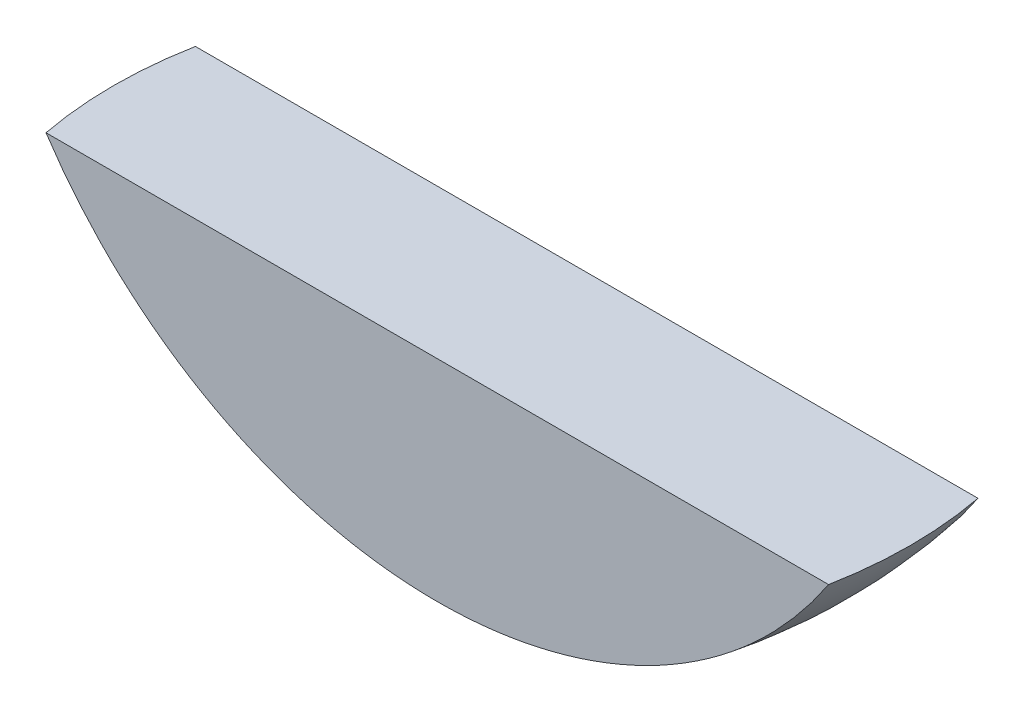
ISO-10303-21;
HEADER;
FILE_DESCRIPTION(('STEP AP214'),'2;1');
FILE_NAME('part.step','',(''),(''),'','','');
FILE_SCHEMA(('AUTOMOTIVE_DESIGN { 1 0 10303 214 1 1 1 1 }'));
ENDSEC;
DATA;
#1=APPLICATION_CONTEXT('core data for automotive mechanical design processes');
#2=APPLICATION_PROTOCOL_DEFINITION('international standard','automotive_design',2000,#1);
#3=PRODUCT_CONTEXT('',#1,'mechanical');
#4=PRODUCT('Part','Part','',(#3));
#5=PRODUCT_RELATED_PRODUCT_CATEGORY('part','',(#4));
#6=PRODUCT_DEFINITION_FORMATION('','',#4);
#7=PRODUCT_DEFINITION_CONTEXT('part definition',#1,'design');
#8=PRODUCT_DEFINITION('design','',#6,#7);
#9=PRODUCT_DEFINITION_SHAPE('','',#8);
#10=(LENGTH_UNIT() NAMED_UNIT(*) SI_UNIT(.MILLI.,.METRE.));
#11=(NAMED_UNIT(*) PLANE_ANGLE_UNIT() SI_UNIT($,.RADIAN.));
#12=(NAMED_UNIT(*) SI_UNIT($,.STERADIAN.) SOLID_ANGLE_UNIT());
#13=UNCERTAINTY_MEASURE_WITH_UNIT(LENGTH_MEASURE(1.E-05),#10,'distance_accuracy_value','');
#14=(GEOMETRIC_REPRESENTATION_CONTEXT(3) GLOBAL_UNCERTAINTY_ASSIGNED_CONTEXT((#13)) GLOBAL_UNIT_ASSIGNED_CONTEXT((#10,
#11,#12)) REPRESENTATION_CONTEXT('',''));
#15=CARTESIAN_POINT('',(0.,0.,0.));
#16=DIRECTION('',(0.,0.,1.));
#17=DIRECTION('',(1.,0.,0.));
#18=AXIS2_PLACEMENT_3D('',#15,#16,#17);
#19=CARTESIAN_POINT('',(0.,0.,0.));
#20=DIRECTION('',(0.,-1.,0.));
#21=DIRECTION('',(-1.,0.,0.));
#22=AXIS2_PLACEMENT_3D('',#19,#20,#21);
#23=SPHERICAL_SURFACE('',#22,190.7);
#24=CARTESIAN_POINT('',(0.,0.,-30.));
#25=DIRECTION('',(0.,0.,-1.));
#26=DIRECTION('',(-1.,0.,0.));
#27=AXIS2_PLACEMENT_3D('',#24,#25,#26);
#28=CIRCLE('',#27,188.325489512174);
#29=CARTESIAN_POINT('',(157.115109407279,-103.833195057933,-30.));
#30=VERTEX_POINT('',#29);
#31=CARTESIAN_POINT('',(-157.115109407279,-103.833195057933,-30.));
#32=VERTEX_POINT('',#31);
#33=EDGE_CURVE('E11',#30,#32,#28,.T.);
#34=ORIENTED_EDGE('',*,*,#33,.F.);
#35=CARTESIAN_POINT('',(0.,-103.833195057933,0.));
#36=DIRECTION('',(0.,-1.,0.));
#37=DIRECTION('',(0.,0.,-1.));
#38=AXIS2_PLACEMENT_3D('',#35,#36,#37);
#39=CIRCLE('',#38,159.953610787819);
#40=CARTESIAN_POINT('',(157.115109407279,-103.833195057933,30.));
#41=VERTEX_POINT('',#40);
#42=EDGE_CURVE('E41',#30,#41,#39,.T.);
#43=ORIENTED_EDGE('',*,*,#42,.T.);
#44=CARTESIAN_POINT('',(0.,0.,30.));
#45=DIRECTION('',(0.,0.,-1.));
#46=DIRECTION('',(-1.,0.,0.));
#47=AXIS2_PLACEMENT_3D('',#44,#45,#46);
#48=CIRCLE('',#47,188.325489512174);
#49=CARTESIAN_POINT('',(-157.115109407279,-103.833195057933,30.));
#50=VERTEX_POINT('',#49);
#51=EDGE_CURVE('E59',#41,#50,#48,.T.);
#52=ORIENTED_EDGE('',*,*,#51,.T.);
#53=EDGE_CURVE('E63',#50,#32,#39,.T.);
#54=ORIENTED_EDGE('',*,*,#53,.T.);
#55=EDGE_LOOP('',(#34,#43,#52,#54));
#56=FACE_BOUND('',#55,.T.);
#57=ADVANCED_FACE('F34',(#56),#23,.T.);
#58=CARTESIAN_POINT('',(-246.634398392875,-103.833195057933,-30.));
#59=DIRECTION('',(0.,-1.,0.));
#60=DIRECTION('',(0.,0.,-1.));
#61=AXIS2_PLACEMENT_3D('',#58,#59,#60);
#62=PLANE('',#61);
#63=ORIENTED_EDGE('',*,*,#42,.F.);
#64=DIRECTION('',(1.,0.,0.));
#65=VECTOR('',#64,1.);
#66=CARTESIAN_POINT('',(-246.634398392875,-103.833195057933,-30.));
#67=LINE('',#66,#65);
#68=EDGE_CURVE('E64',#32,#30,#67,.T.);
#69=ORIENTED_EDGE('',*,*,#68,.F.);
#70=ORIENTED_EDGE('',*,*,#53,.F.);
#71=DIRECTION('',(1.,0.,0.));
#72=VECTOR('',#71,1.);
#73=CARTESIAN_POINT('',(-246.634398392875,-103.833195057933,30.));
#74=LINE('',#73,#72);
#75=EDGE_CURVE('E47',#50,#41,#74,.T.);
#76=ORIENTED_EDGE('',*,*,#75,.T.);
#77=EDGE_LOOP('',(#63,#69,#70,#76));
#78=FACE_BOUND('',#77,.T.);
#79=ADVANCED_FACE('F66',(#78),#62,.F.);
#80=CARTESIAN_POINT('',(0.,0.,-30.));
#81=DIRECTION('',(0.,0.,-1.));
#82=DIRECTION('',(-1.,0.,0.));
#83=AXIS2_PLACEMENT_3D('',#80,#81,#82);
#84=PLANE('',#83);
#85=ORIENTED_EDGE('',*,*,#68,.T.);
#86=ORIENTED_EDGE('',*,*,#33,.T.);
#87=EDGE_LOOP('',(#85,#86));
#88=FACE_BOUND('',#87,.T.);
#89=ADVANCED_FACE('F71',(#88),#84,.T.);
#90=CARTESIAN_POINT('',(0.,0.,30.));
#91=DIRECTION('',(0.,0.,-1.));
#92=DIRECTION('',(-1.,0.,0.));
#93=AXIS2_PLACEMENT_3D('',#90,#91,#92);
#94=PLANE('',#93);
#95=ORIENTED_EDGE('',*,*,#51,.F.);
#96=ORIENTED_EDGE('',*,*,#75,.F.);
#97=EDGE_LOOP('',(#95,#96));
#98=FACE_BOUND('',#97,.T.);
#99=ADVANCED_FACE('F60',(#98),#94,.F.);
#100=CLOSED_SHELL('',(#57,#79,#89,#99));
#101=MANIFOLD_SOLID_BREP('B2',#100);
#102=ADVANCED_BREP_SHAPE_REPRESENTATION('',(#18,#101),#14);
#103=SHAPE_DEFINITION_REPRESENTATION(#9,#102);
ENDSEC;
END-ISO-10303-21;
